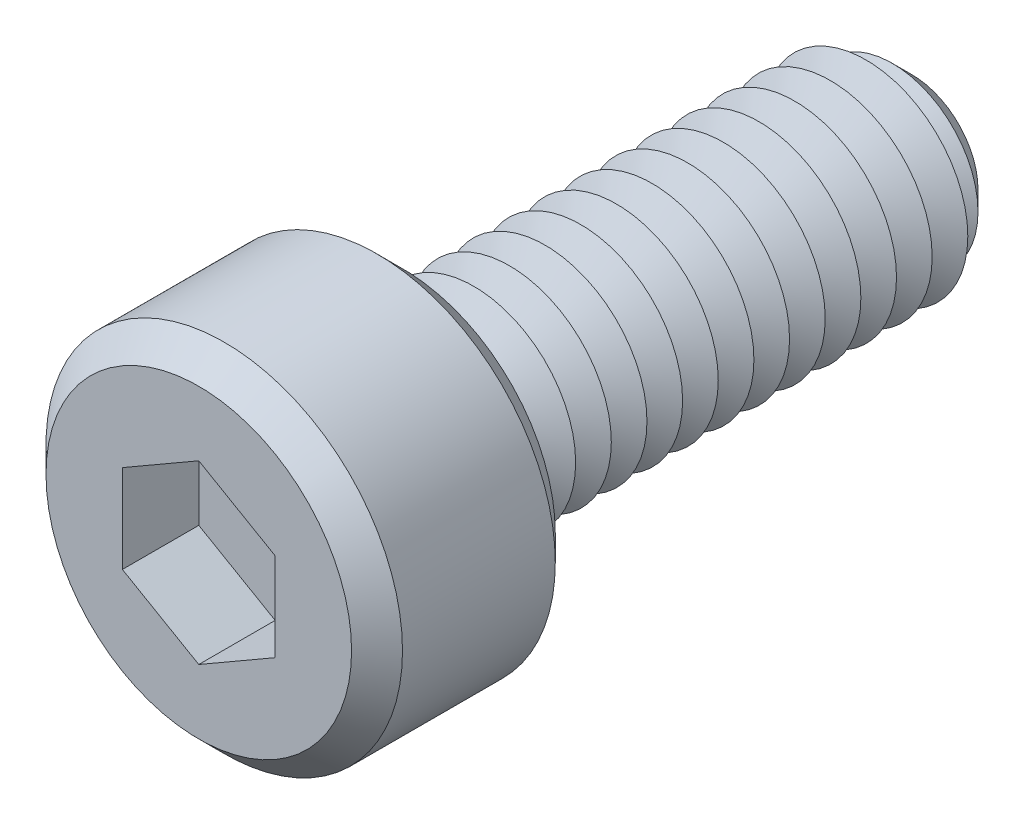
from build123d import *

# Parameters (mm, degrees)
SKETCH1_R           = 3.5
BOSS_EXTRUDE1_DEPTH = 4
SKETCH2_R           = 2
BOSS_EXTRUDE2_DEPTH = 10
CHAMFER1_SIZE       = 0.7
LPATTERN1_COUNT     = 14
LPATTERN1_PITCH     = 0.7
CUT_EXTRUDE1_DEPTH  = 1.5
SKETCH6_R           = 0.5
CUT_EXTRUDE2_DEPTH  = 12.5
CHAMFER2_SIZE       = 0.5


with BuildPart() as part:
    # Sketch1 → Boss-Extrude1 (new body)
    with BuildSketch(Plane.XY):
        Circle(SKETCH1_R)
    extrude(amount=BOSS_EXTRUDE1_DEPTH)

    # Sketch2 → Boss-Extrude2 (add)
    with BuildSketch(Plane(origin=(0, 0, 0), x_dir=(-1, 0, 0), z_dir=(0, 0, -1))):
        Circle(SKETCH2_R)
    extrude(amount=BOSS_EXTRUDE2_DEPTH)

    # Chamfer1
    chamfer1_edges = [part.edges().sort_by_distance(p)[0] for p in [
        (2, 0, -10),
    ]]
    chamfer(chamfer1_edges, length=CHAMFER1_SIZE)

    # Sketch4 → Cut-Revolve1 (revolve, cut)
    with BuildSketch(Plane(origin=(0, 0, 0), x_dir=(0, 0, -1), z_dir=(1, 0, 0)), mode=Mode.PRIVATE) as cut_revolve1_sk:
        Polygon((0, 2), (0.35, 1.393782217), (0.7, 2), align=None)
    cut_revolve1 = revolve(cut_revolve1_sk.sketch.rotate(Axis((0, 0, 2.512122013), (0, 0, -1)), 90), axis=Axis((0, 0, 2.512122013), (0, 0, -1)), mode=Mode.SUBTRACT)

    # LPattern1: Cut-Revolve1 ×14
    with Locations(*[(0, 0, -i * LPATTERN1_PITCH) for i in range(1, LPATTERN1_COUNT)]):
        add(cut_revolve1, mode=Mode.SUBTRACT)

    # Sketch5 → Cut-Extrude1 (cut)
    with BuildSketch(Plane.XY.offset(4)):
        Polygon((0, 1.732050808), (-1.5, 0.866025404), (-1.5, -0.866025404), (0, -1.732050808), (1.5, -0.866025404), (1.5, 0.866025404), align=None)
    extrude(amount=-CUT_EXTRUDE1_DEPTH, mode=Mode.SUBTRACT)

    # Sketch6 → Cut-Extrude2 (cut)
    with BuildSketch(Plane.XY.offset(2.5)):
        Circle(SKETCH6_R)
    extrude(amount=-CUT_EXTRUDE2_DEPTH, mode=Mode.SUBTRACT)

    # Chamfer2
    chamfer2_edges = [part.edges().sort_by_distance(p)[0] for p in [
        (-3.5, 0, 0),
        (-3.5, 0, 4),
    ]]
    chamfer(chamfer2_edges, length=CHAMFER2_SIZE)


solid = part.part
